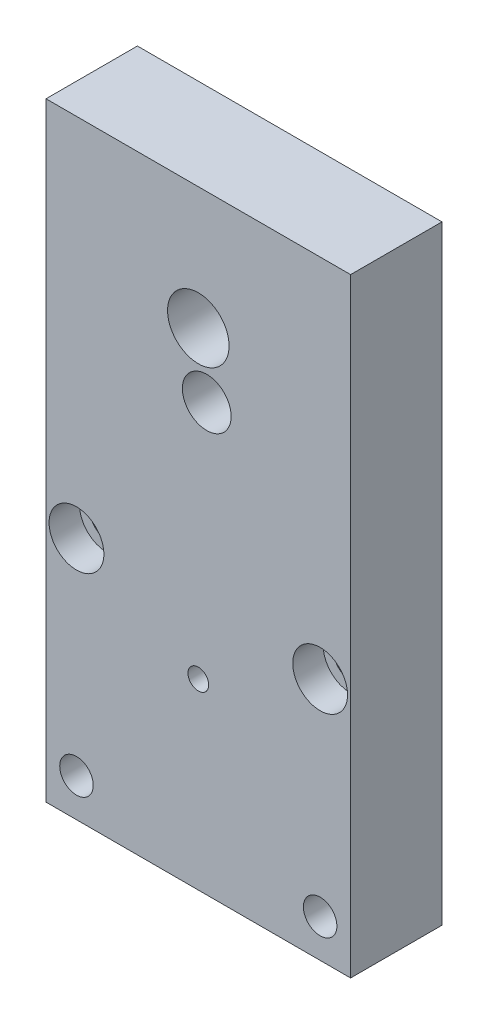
ISO-10303-21;
HEADER;
FILE_DESCRIPTION(('STEP AP214'),'2;1');
FILE_NAME('part.step','',(''),(''),'','','');
FILE_SCHEMA(('AUTOMOTIVE_DESIGN { 1 0 10303 214 1 1 1 1 }'));
ENDSEC;
DATA;
#1=APPLICATION_CONTEXT('core data for automotive mechanical design processes');
#2=APPLICATION_PROTOCOL_DEFINITION('international standard','automotive_design',2000,#1);
#3=PRODUCT_CONTEXT('',#1,'mechanical');
#4=PRODUCT('Part','Part','',(#3));
#5=PRODUCT_RELATED_PRODUCT_CATEGORY('part','',(#4));
#6=PRODUCT_DEFINITION_FORMATION('','',#4);
#7=PRODUCT_DEFINITION_CONTEXT('part definition',#1,'design');
#8=PRODUCT_DEFINITION('design','',#6,#7);
#9=PRODUCT_DEFINITION_SHAPE('','',#8);
#10=(LENGTH_UNIT() NAMED_UNIT(*) SI_UNIT(.MILLI.,.METRE.));
#11=(NAMED_UNIT(*) PLANE_ANGLE_UNIT() SI_UNIT($,.RADIAN.));
#12=(NAMED_UNIT(*) SI_UNIT($,.STERADIAN.) SOLID_ANGLE_UNIT());
#13=UNCERTAINTY_MEASURE_WITH_UNIT(LENGTH_MEASURE(1.E-05),#10,'distance_accuracy_value','');
#14=(GEOMETRIC_REPRESENTATION_CONTEXT(3) GLOBAL_UNCERTAINTY_ASSIGNED_CONTEXT((#13)) GLOBAL_UNIT_ASSIGNED_CONTEXT((#10,
#11,#12)) REPRESENTATION_CONTEXT('',''));
#15=CARTESIAN_POINT('',(0.,0.,0.));
#16=DIRECTION('',(0.,0.,1.));
#17=DIRECTION('',(1.,0.,0.));
#18=AXIS2_PLACEMENT_3D('',#15,#16,#17);
#19=CARTESIAN_POINT('',(-40.,80.,0.));
#20=DIRECTION('',(0.,0.,-1.));
#21=DIRECTION('',(-1.,0.,0.));
#22=AXIS2_PLACEMENT_3D('',#19,#20,#21);
#23=CYLINDRICAL_SURFACE('',#22,5.49999999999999);
#24=CARTESIAN_POINT('',(-40.,80.,0.));
#25=DIRECTION('',(0.,0.,-1.));
#26=DIRECTION('',(-1.,0.,0.));
#27=AXIS2_PLACEMENT_3D('',#24,#25,#26);
#28=CIRCLE('',#27,5.49999999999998);
#29=CARTESIAN_POINT('',(-45.5,80.,0.));
#30=VERTEX_POINT('',#29);
#31=EDGE_CURVE('E159',#30,#30,#28,.T.);
#32=ORIENTED_EDGE('',*,*,#31,.T.);
#33=EDGE_LOOP('',(#32));
#34=FACE_BOUND('',#33,.T.);
#35=CARTESIAN_POINT('',(-40.,80.,20.));
#36=DIRECTION('',(0.,0.,1.));
#37=DIRECTION('',(1.,0.,0.));
#38=AXIS2_PLACEMENT_3D('',#35,#36,#37);
#39=CIRCLE('',#38,5.49999999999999);
#40=CARTESIAN_POINT('',(-34.5,80.,20.));
#41=VERTEX_POINT('',#40);
#42=EDGE_CURVE('E43',#41,#41,#39,.F.);
#43=ORIENTED_EDGE('',*,*,#42,.F.);
#44=EDGE_LOOP('',(#43));
#45=FACE_BOUND('',#44,.T.);
#46=ADVANCED_FACE('F39',(#34,#45),#23,.F.);
#47=CARTESIAN_POINT('',(40.,80.,0.));
#48=DIRECTION('',(0.,0.,-1.));
#49=DIRECTION('',(-1.,0.,0.));
#50=AXIS2_PLACEMENT_3D('',#47,#48,#49);
#51=CYLINDRICAL_SURFACE('',#50,5.49999999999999);
#52=CARTESIAN_POINT('',(40.,80.,0.));
#53=DIRECTION('',(0.,0.,-1.));
#54=DIRECTION('',(-1.,0.,0.));
#55=AXIS2_PLACEMENT_3D('',#52,#53,#54);
#56=CIRCLE('',#55,5.49999999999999);
#57=CARTESIAN_POINT('',(34.5,80.,0.));
#58=VERTEX_POINT('',#57);
#59=EDGE_CURVE('E156',#58,#58,#56,.T.);
#60=ORIENTED_EDGE('',*,*,#59,.T.);
#61=EDGE_LOOP('',(#60));
#62=FACE_BOUND('',#61,.T.);
#63=CARTESIAN_POINT('',(40.,80.,20.));
#64=DIRECTION('',(0.,0.,1.));
#65=DIRECTION('',(1.,0.,0.));
#66=AXIS2_PLACEMENT_3D('',#63,#64,#65);
#67=CIRCLE('',#66,5.49999999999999);
#68=CARTESIAN_POINT('',(45.5,80.,20.));
#69=VERTEX_POINT('',#68);
#70=EDGE_CURVE('E134',#69,#69,#67,.F.);
#71=ORIENTED_EDGE('',*,*,#70,.F.);
#72=EDGE_LOOP('',(#71));
#73=FACE_BOUND('',#72,.T.);
#74=ADVANCED_FACE('F196',(#62,#73),#51,.F.);
#75=CARTESIAN_POINT('',(-50.,0.,30.));
#76=DIRECTION('',(1.,0.,0.));
#77=DIRECTION('',(0.,0.,-1.));
#78=AXIS2_PLACEMENT_3D('',#75,#76,#77);
#79=PLANE('',#78);
#80=DIRECTION('',(0.,-1.,0.));
#81=VECTOR('',#80,1.);
#82=CARTESIAN_POINT('',(-50.,0.,0.));
#83=LINE('',#82,#81);
#84=CARTESIAN_POINT('',(-50.,200.,0.));
#85=VERTEX_POINT('',#84);
#86=CARTESIAN_POINT('',(-50.,0.,0.));
#87=VERTEX_POINT('',#86);
#88=EDGE_CURVE('E174',#85,#87,#83,.T.);
#89=ORIENTED_EDGE('',*,*,#88,.T.);
#90=DIRECTION('',(0.,0.,-1.));
#91=VECTOR('',#90,1.);
#92=CARTESIAN_POINT('',(-50.,0.,30.));
#93=LINE('',#92,#91);
#94=CARTESIAN_POINT('',(-50.,0.,30.));
#95=VERTEX_POINT('',#94);
#96=EDGE_CURVE('E11',#95,#87,#93,.T.);
#97=ORIENTED_EDGE('',*,*,#96,.F.);
#98=DIRECTION('',(0.,-1.,0.));
#99=VECTOR('',#98,1.);
#100=CARTESIAN_POINT('',(-50.,0.,30.));
#101=LINE('',#100,#99);
#102=CARTESIAN_POINT('',(-50.,200.,30.));
#103=VERTEX_POINT('',#102);
#104=EDGE_CURVE('E175',#103,#95,#101,.T.);
#105=ORIENTED_EDGE('',*,*,#104,.F.);
#106=DIRECTION('',(0.,0.,-1.));
#107=VECTOR('',#106,1.);
#108=CARTESIAN_POINT('',(-50.,200.,30.));
#109=LINE('',#108,#107);
#110=EDGE_CURVE('E181',#103,#85,#109,.T.);
#111=ORIENTED_EDGE('',*,*,#110,.T.);
#112=EDGE_LOOP('',(#89,#97,#105,#111));
#113=FACE_BOUND('',#112,.T.);
#114=ADVANCED_FACE('F41',(#113),#79,.F.);
#115=CARTESIAN_POINT('',(-50.,0.,30.));
#116=DIRECTION('',(0.,1.,0.));
#117=DIRECTION('',(-1.,0.,0.));
#118=AXIS2_PLACEMENT_3D('',#115,#116,#117);
#119=PLANE('',#118);
#120=DIRECTION('',(1.,0.,0.));
#121=VECTOR('',#120,1.);
#122=CARTESIAN_POINT('',(-50.,0.,0.));
#123=LINE('',#122,#121);
#124=CARTESIAN_POINT('',(50.,0.,0.));
#125=VERTEX_POINT('',#124);
#126=EDGE_CURVE('E184',#87,#125,#123,.T.);
#127=ORIENTED_EDGE('',*,*,#126,.T.);
#128=DIRECTION('',(0.,0.,-1.));
#129=VECTOR('',#128,1.);
#130=CARTESIAN_POINT('',(50.,0.,30.));
#131=LINE('',#130,#129);
#132=CARTESIAN_POINT('',(50.,0.,30.));
#133=VERTEX_POINT('',#132);
#134=EDGE_CURVE('E49',#133,#125,#131,.T.);
#135=ORIENTED_EDGE('',*,*,#134,.F.);
#136=DIRECTION('',(1.,0.,0.));
#137=VECTOR('',#136,1.);
#138=CARTESIAN_POINT('',(-50.,0.,30.));
#139=LINE('',#138,#137);
#140=EDGE_CURVE('E89',#95,#133,#139,.T.);
#141=ORIENTED_EDGE('',*,*,#140,.F.);
#142=ORIENTED_EDGE('',*,*,#96,.T.);
#143=EDGE_LOOP('',(#127,#135,#141,#142));
#144=FACE_BOUND('',#143,.T.);
#145=ADVANCED_FACE('F204',(#144),#119,.F.);
#146=CARTESIAN_POINT('',(50.,0.,30.));
#147=DIRECTION('',(-1.,0.,0.));
#148=DIRECTION('',(0.,-1.,0.));
#149=AXIS2_PLACEMENT_3D('',#146,#147,#148);
#150=PLANE('',#149);
#151=DIRECTION('',(0.,1.,0.));
#152=VECTOR('',#151,1.);
#153=CARTESIAN_POINT('',(50.,0.,0.));
#154=LINE('',#153,#152);
#155=CARTESIAN_POINT('',(49.9999999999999,200.,0.));
#156=VERTEX_POINT('',#155);
#157=EDGE_CURVE('E76',#125,#156,#154,.T.);
#158=ORIENTED_EDGE('',*,*,#157,.T.);
#159=DIRECTION('',(0.,0.,-1.));
#160=VECTOR('',#159,1.);
#161=CARTESIAN_POINT('',(49.9999999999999,200.,30.));
#162=LINE('',#161,#160);
#163=CARTESIAN_POINT('',(49.9999999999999,200.,30.));
#164=VERTEX_POINT('',#163);
#165=EDGE_CURVE('E189',#164,#156,#162,.T.);
#166=ORIENTED_EDGE('',*,*,#165,.F.);
#167=DIRECTION('',(0.,1.,0.));
#168=VECTOR('',#167,1.);
#169=CARTESIAN_POINT('',(50.,0.,30.));
#170=LINE('',#169,#168);
#171=EDGE_CURVE('E178',#133,#164,#170,.T.);
#172=ORIENTED_EDGE('',*,*,#171,.F.);
#173=ORIENTED_EDGE('',*,*,#134,.T.);
#174=EDGE_LOOP('',(#158,#166,#172,#173));
#175=FACE_BOUND('',#174,.T.);
#176=ADVANCED_FACE('F231',(#175),#150,.F.);
#177=CARTESIAN_POINT('',(-50.,200.,30.));
#178=DIRECTION('',(0.,-1.,0.));
#179=DIRECTION('',(1.,0.,0.));
#180=AXIS2_PLACEMENT_3D('',#177,#178,#179);
#181=PLANE('',#180);
#182=DIRECTION('',(-1.,0.,0.));
#183=VECTOR('',#182,1.);
#184=CARTESIAN_POINT('',(-50.,200.,0.));
#185=LINE('',#184,#183);
#186=EDGE_CURVE('E82',#156,#85,#185,.T.);
#187=ORIENTED_EDGE('',*,*,#186,.T.);
#188=ORIENTED_EDGE('',*,*,#110,.F.);
#189=DIRECTION('',(-1.,0.,0.));
#190=VECTOR('',#189,1.);
#191=CARTESIAN_POINT('',(-50.,200.,30.));
#192=LINE('',#191,#190);
#193=EDGE_CURVE('E58',#164,#103,#192,.T.);
#194=ORIENTED_EDGE('',*,*,#193,.F.);
#195=ORIENTED_EDGE('',*,*,#165,.T.);
#196=EDGE_LOOP('',(#187,#188,#194,#195));
#197=FACE_BOUND('',#196,.T.);
#198=ADVANCED_FACE('F224',(#197),#181,.F.);
#199=CARTESIAN_POINT('',(-50.,200.,30.));
#200=DIRECTION('',(0.,0.,-1.));
#201=DIRECTION('',(-1.,0.,0.));
#202=AXIS2_PLACEMENT_3D('',#199,#200,#201);
#203=PLANE('',#202);
#204=CARTESIAN_POINT('',(2.76954470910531,140.043665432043,30.));
#205=DIRECTION('',(0.,0.,1.));
#206=DIRECTION('',(1.,0.,0.));
#207=AXIS2_PLACEMENT_3D('',#204,#205,#206);
#208=CIRCLE('',#207,8.);
#209=CARTESIAN_POINT('',(10.7695447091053,140.043665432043,30.));
#210=VERTEX_POINT('',#209);
#211=EDGE_CURVE('E113',#210,#210,#208,.T.);
#212=ORIENTED_EDGE('',*,*,#211,.F.);
#213=EDGE_LOOP('',(#212));
#214=FACE_BOUND('',#213,.T.);
#215=CARTESIAN_POINT('',(0.,159.75,30.));
#216=DIRECTION('',(0.,0.,1.));
#217=DIRECTION('',(1.,0.,0.));
#218=AXIS2_PLACEMENT_3D('',#215,#216,#217);
#219=CIRCLE('',#218,10.1);
#220=CARTESIAN_POINT('',(10.1,159.75,30.));
#221=VERTEX_POINT('',#220);
#222=EDGE_CURVE('E119',#221,#221,#219,.T.);
#223=ORIENTED_EDGE('',*,*,#222,.F.);
#224=EDGE_LOOP('',(#223));
#225=FACE_BOUND('',#224,.T.);
#226=CARTESIAN_POINT('',(-40.,80.,30.));
#227=DIRECTION('',(0.,0.,1.));
#228=DIRECTION('',(1.,0.,0.));
#229=AXIS2_PLACEMENT_3D('',#226,#227,#228);
#230=CIRCLE('',#229,9.00000000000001);
#231=CARTESIAN_POINT('',(-31.,80.,30.));
#232=VERTEX_POINT('',#231);
#233=EDGE_CURVE('E123',#232,#232,#230,.T.);
#234=ORIENTED_EDGE('',*,*,#233,.F.);
#235=EDGE_LOOP('',(#234));
#236=FACE_BOUND('',#235,.T.);
#237=CARTESIAN_POINT('',(40.,80.,30.));
#238=DIRECTION('',(0.,0.,1.));
#239=DIRECTION('',(1.,0.,0.));
#240=AXIS2_PLACEMENT_3D('',#237,#238,#239);
#241=CIRCLE('',#240,9.00000000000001);
#242=CARTESIAN_POINT('',(49.,80.,30.));
#243=VERTEX_POINT('',#242);
#244=EDGE_CURVE('E135',#243,#243,#241,.T.);
#245=ORIENTED_EDGE('',*,*,#244,.F.);
#246=EDGE_LOOP('',(#245));
#247=FACE_BOUND('',#246,.T.);
#248=CARTESIAN_POINT('',(0.,60.,30.));
#249=DIRECTION('',(0.,0.,-1.));
#250=DIRECTION('',(-1.,0.,0.));
#251=AXIS2_PLACEMENT_3D('',#248,#249,#250);
#252=CIRCLE('',#251,3.39999999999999);
#253=CARTESIAN_POINT('',(-3.39999999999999,60.,30.));
#254=VERTEX_POINT('',#253);
#255=EDGE_CURVE('E153',#254,#254,#252,.T.);
#256=ORIENTED_EDGE('',*,*,#255,.T.);
#257=EDGE_LOOP('',(#256));
#258=FACE_BOUND('',#257,.T.);
#259=CARTESIAN_POINT('',(-40.,12.5,30.));
#260=DIRECTION('',(0.,0.,-1.));
#261=DIRECTION('',(-1.,0.,0.));
#262=AXIS2_PLACEMENT_3D('',#259,#260,#261);
#263=CIRCLE('',#262,5.49999999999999);
#264=CARTESIAN_POINT('',(-45.5,12.5,30.));
#265=VERTEX_POINT('',#264);
#266=EDGE_CURVE('E165',#265,#265,#263,.T.);
#267=ORIENTED_EDGE('',*,*,#266,.T.);
#268=EDGE_LOOP('',(#267));
#269=FACE_BOUND('',#268,.T.);
#270=CARTESIAN_POINT('',(40.,12.5,30.));
#271=DIRECTION('',(0.,0.,-1.));
#272=DIRECTION('',(-1.,0.,0.));
#273=AXIS2_PLACEMENT_3D('',#270,#271,#272);
#274=CIRCLE('',#273,5.49999999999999);
#275=CARTESIAN_POINT('',(34.5,12.5,30.));
#276=VERTEX_POINT('',#275);
#277=EDGE_CURVE('E171',#276,#276,#274,.T.);
#278=ORIENTED_EDGE('',*,*,#277,.T.);
#279=EDGE_LOOP('',(#278));
#280=FACE_BOUND('',#279,.T.);
#281=ORIENTED_EDGE('',*,*,#104,.T.);
#282=ORIENTED_EDGE('',*,*,#140,.T.);
#283=ORIENTED_EDGE('',*,*,#171,.T.);
#284=ORIENTED_EDGE('',*,*,#193,.T.);
#285=EDGE_LOOP('',(#281,#282,#283,#284));
#286=FACE_BOUND('',#285,.T.);
#287=ADVANCED_FACE('F221',(#214,#225,#236,#247,#258,#269,#280,#286),#203,.F.);
#288=CARTESIAN_POINT('',(-50.,200.,0.));
#289=DIRECTION('',(0.,0.,-1.));
#290=DIRECTION('',(-1.,0.,0.));
#291=AXIS2_PLACEMENT_3D('',#288,#289,#290);
#292=PLANE('',#291);
#293=CARTESIAN_POINT('',(2.76954470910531,140.043665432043,0.));
#294=DIRECTION('',(0.,0.,-1.));
#295=DIRECTION('',(-1.,0.,0.));
#296=AXIS2_PLACEMENT_3D('',#293,#294,#295);
#297=CIRCLE('',#296,8.);
#298=CARTESIAN_POINT('',(-5.2304552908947,140.043665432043,0.));
#299=VERTEX_POINT('',#298);
#300=EDGE_CURVE('E445',#299,#299,#297,.F.);
#301=ORIENTED_EDGE('',*,*,#300,.T.);
#302=EDGE_LOOP('',(#301));
#303=FACE_BOUND('',#302,.T.);
#304=CARTESIAN_POINT('',(-38.,182.5,0.));
#305=DIRECTION('',(0.,0.,-1.));
#306=DIRECTION('',(-1.,0.,0.));
#307=AXIS2_PLACEMENT_3D('',#304,#305,#306);
#308=CIRCLE('',#307,3.4);
#309=CARTESIAN_POINT('',(-41.4,182.5,0.));
#310=VERTEX_POINT('',#309);
#311=EDGE_CURVE('E107',#310,#310,#308,.T.);
#312=ORIENTED_EDGE('',*,*,#311,.F.);
#313=EDGE_LOOP('',(#312));
#314=FACE_BOUND('',#313,.T.);
#315=CARTESIAN_POINT('',(38.,182.5,0.));
#316=DIRECTION('',(0.,0.,-1.));
#317=DIRECTION('',(-1.,0.,0.));
#318=AXIS2_PLACEMENT_3D('',#315,#316,#317);
#319=CIRCLE('',#318,3.4);
#320=CARTESIAN_POINT('',(34.6,182.5,0.));
#321=VERTEX_POINT('',#320);
#322=EDGE_CURVE('E106',#321,#321,#319,.T.);
#323=ORIENTED_EDGE('',*,*,#322,.F.);
#324=EDGE_LOOP('',(#323));
#325=FACE_BOUND('',#324,.T.);
#326=CARTESIAN_POINT('',(0.,159.75,0.));
#327=DIRECTION('',(0.,0.,1.));
#328=DIRECTION('',(1.,0.,0.));
#329=AXIS2_PLACEMENT_3D('',#326,#327,#328);
#330=CIRCLE('',#329,10.1);
#331=CARTESIAN_POINT('',(10.1,159.75,0.));
#332=VERTEX_POINT('',#331);
#333=EDGE_CURVE('E120',#332,#332,#330,.T.);
#334=ORIENTED_EDGE('',*,*,#333,.T.);
#335=EDGE_LOOP('',(#334));
#336=FACE_BOUND('',#335,.T.);
#337=CARTESIAN_POINT('',(0.,78.,0.));
#338=DIRECTION('',(0.,0.,-1.));
#339=DIRECTION('',(-1.,0.,0.));
#340=AXIS2_PLACEMENT_3D('',#337,#338,#339);
#341=CIRCLE('',#340,4.00000000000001);
#342=CARTESIAN_POINT('',(-4.00000000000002,78.,0.));
#343=VERTEX_POINT('',#342);
#344=EDGE_CURVE('E142',#343,#343,#341,.T.);
#345=ORIENTED_EDGE('',*,*,#344,.F.);
#346=EDGE_LOOP('',(#345));
#347=FACE_BOUND('',#346,.T.);
#348=CARTESIAN_POINT('',(0.,42.,0.));
#349=DIRECTION('',(0.,0.,-1.));
#350=DIRECTION('',(-1.,0.,0.));
#351=AXIS2_PLACEMENT_3D('',#348,#349,#350);
#352=CIRCLE('',#351,4.00000000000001);
#353=CARTESIAN_POINT('',(-4.00000000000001,42.,0.));
#354=VERTEX_POINT('',#353);
#355=EDGE_CURVE('E141',#354,#354,#352,.T.);
#356=ORIENTED_EDGE('',*,*,#355,.F.);
#357=EDGE_LOOP('',(#356));
#358=FACE_BOUND('',#357,.T.);
#359=CARTESIAN_POINT('',(0.,60.,0.));
#360=DIRECTION('',(0.,0.,-1.));
#361=DIRECTION('',(-1.,0.,0.));
#362=AXIS2_PLACEMENT_3D('',#359,#360,#361);
#363=CIRCLE('',#362,3.39999999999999);
#364=CARTESIAN_POINT('',(-3.39999999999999,60.,0.));
#365=VERTEX_POINT('',#364);
#366=EDGE_CURVE('E148',#365,#365,#363,.T.);
#367=ORIENTED_EDGE('',*,*,#366,.F.);
#368=EDGE_LOOP('',(#367));
#369=FACE_BOUND('',#368,.T.);
#370=ORIENTED_EDGE('',*,*,#59,.F.);
#371=EDGE_LOOP('',(#370));
#372=FACE_BOUND('',#371,.T.);
#373=ORIENTED_EDGE('',*,*,#31,.F.);
#374=EDGE_LOOP('',(#373));
#375=FACE_BOUND('',#374,.T.);
#376=CARTESIAN_POINT('',(-40.,12.5,0.));
#377=DIRECTION('',(0.,0.,-1.));
#378=DIRECTION('',(-1.,0.,0.));
#379=AXIS2_PLACEMENT_3D('',#376,#377,#378);
#380=CIRCLE('',#379,5.49999999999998);
#381=CARTESIAN_POINT('',(-45.5,12.5,0.));
#382=VERTEX_POINT('',#381);
#383=EDGE_CURVE('E162',#382,#382,#380,.T.);
#384=ORIENTED_EDGE('',*,*,#383,.F.);
#385=EDGE_LOOP('',(#384));
#386=FACE_BOUND('',#385,.T.);
#387=CARTESIAN_POINT('',(40.,12.5,0.));
#388=DIRECTION('',(0.,0.,-1.));
#389=DIRECTION('',(-1.,0.,0.));
#390=AXIS2_PLACEMENT_3D('',#387,#388,#389);
#391=CIRCLE('',#390,5.49999999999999);
#392=CARTESIAN_POINT('',(34.5,12.5,0.));
#393=VERTEX_POINT('',#392);
#394=EDGE_CURVE('E168',#393,#393,#391,.T.);
#395=ORIENTED_EDGE('',*,*,#394,.F.);
#396=EDGE_LOOP('',(#395));
#397=FACE_BOUND('',#396,.T.);
#398=ORIENTED_EDGE('',*,*,#88,.F.);
#399=ORIENTED_EDGE('',*,*,#186,.F.);
#400=ORIENTED_EDGE('',*,*,#157,.F.);
#401=ORIENTED_EDGE('',*,*,#126,.F.);
#402=EDGE_LOOP('',(#398,#399,#400,#401));
#403=FACE_BOUND('',#402,.T.);
#404=ADVANCED_FACE('F219',(#303,#314,#325,#336,#347,#358,#369,#372,#375,#386,#397,#403),#292,.T.);
#405=CARTESIAN_POINT('',(40.,12.5,0.));
#406=DIRECTION('',(0.,0.,-1.));
#407=DIRECTION('',(-1.,0.,0.));
#408=AXIS2_PLACEMENT_3D('',#405,#406,#407);
#409=CYLINDRICAL_SURFACE('',#408,5.49999999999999);
#410=ORIENTED_EDGE('',*,*,#277,.F.);
#411=EDGE_LOOP('',(#410));
#412=FACE_BOUND('',#411,.T.);
#413=ORIENTED_EDGE('',*,*,#394,.T.);
#414=EDGE_LOOP('',(#413));
#415=FACE_BOUND('',#414,.T.);
#416=ADVANCED_FACE('F215',(#412,#415),#409,.F.);
#417=CARTESIAN_POINT('',(-40.,12.5,0.));
#418=DIRECTION('',(0.,0.,-1.));
#419=DIRECTION('',(-1.,0.,0.));
#420=AXIS2_PLACEMENT_3D('',#417,#418,#419);
#421=CYLINDRICAL_SURFACE('',#420,5.49999999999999);
#422=ORIENTED_EDGE('',*,*,#266,.F.);
#423=EDGE_LOOP('',(#422));
#424=FACE_BOUND('',#423,.T.);
#425=ORIENTED_EDGE('',*,*,#383,.T.);
#426=EDGE_LOOP('',(#425));
#427=FACE_BOUND('',#426,.T.);
#428=ADVANCED_FACE('F212',(#424,#427),#421,.F.);
#429=CARTESIAN_POINT('',(0.,60.,0.));
#430=DIRECTION('',(0.,0.,-1.));
#431=DIRECTION('',(-1.,0.,0.));
#432=AXIS2_PLACEMENT_3D('',#429,#430,#431);
#433=CYLINDRICAL_SURFACE('',#432,3.39999999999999);
#434=ORIENTED_EDGE('',*,*,#255,.F.);
#435=EDGE_LOOP('',(#434));
#436=FACE_BOUND('',#435,.T.);
#437=ORIENTED_EDGE('',*,*,#366,.T.);
#438=EDGE_LOOP('',(#437));
#439=FACE_BOUND('',#438,.T.);
#440=ADVANCED_FACE('F209',(#436,#439),#433,.F.);
#441=CARTESIAN_POINT('',(0.,42.,10.));
#442=DIRECTION('',(0.,0.,-1.));
#443=DIRECTION('',(-1.,0.,0.));
#444=AXIS2_PLACEMENT_3D('',#441,#442,#443);
#445=CYLINDRICAL_SURFACE('',#444,4.00000000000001);
#446=CARTESIAN_POINT('',(0.,42.,10.));
#447=DIRECTION('',(0.,0.,-1.));
#448=DIRECTION('',(-1.,0.,0.));
#449=AXIS2_PLACEMENT_3D('',#446,#447,#448);
#450=CIRCLE('',#449,4.00000000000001);
#451=CARTESIAN_POINT('',(-4.00000000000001,42.,10.));
#452=VERTEX_POINT('',#451);
#453=EDGE_CURVE('E145',#452,#452,#450,.T.);
#454=ORIENTED_EDGE('',*,*,#453,.F.);
#455=EDGE_LOOP('',(#454));
#456=FACE_BOUND('',#455,.T.);
#457=ORIENTED_EDGE('',*,*,#355,.T.);
#458=EDGE_LOOP('',(#457));
#459=FACE_BOUND('',#458,.T.);
#460=ADVANCED_FACE('F275',(#456,#459),#445,.F.);
#461=CARTESIAN_POINT('',(0.,42.,10.));
#462=DIRECTION('',(0.,0.,-1.));
#463=DIRECTION('',(-1.,0.,0.));
#464=AXIS2_PLACEMENT_3D('',#461,#462,#463);
#465=PLANE('',#464);
#466=ORIENTED_EDGE('',*,*,#453,.T.);
#467=EDGE_LOOP('',(#466));
#468=FACE_BOUND('',#467,.T.);
#469=ADVANCED_FACE('F282',(#468),#465,.T.);
#470=CARTESIAN_POINT('',(0.,78.,10.));
#471=DIRECTION('',(0.,0.,-1.));
#472=DIRECTION('',(-1.,0.,0.));
#473=AXIS2_PLACEMENT_3D('',#470,#471,#472);
#474=CYLINDRICAL_SURFACE('',#473,4.00000000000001);
#475=CARTESIAN_POINT('',(0.,78.,10.));
#476=DIRECTION('',(0.,0.,-1.));
#477=DIRECTION('',(-1.,0.,0.));
#478=AXIS2_PLACEMENT_3D('',#475,#476,#477);
#479=CIRCLE('',#478,4.00000000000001);
#480=CARTESIAN_POINT('',(-4.00000000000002,78.,10.));
#481=VERTEX_POINT('',#480);
#482=EDGE_CURVE('E138',#481,#481,#479,.T.);
#483=ORIENTED_EDGE('',*,*,#482,.F.);
#484=EDGE_LOOP('',(#483));
#485=FACE_BOUND('',#484,.T.);
#486=ORIENTED_EDGE('',*,*,#344,.T.);
#487=EDGE_LOOP('',(#486));
#488=FACE_BOUND('',#487,.T.);
#489=ADVANCED_FACE('F289',(#485,#488),#474,.F.);
#490=CARTESIAN_POINT('',(0.,78.,10.));
#491=DIRECTION('',(0.,0.,-1.));
#492=DIRECTION('',(-1.,0.,0.));
#493=AXIS2_PLACEMENT_3D('',#490,#491,#492);
#494=PLANE('',#493);
#495=ORIENTED_EDGE('',*,*,#482,.T.);
#496=EDGE_LOOP('',(#495));
#497=FACE_BOUND('',#496,.T.);
#498=ADVANCED_FACE('F298',(#497),#494,.T.);
#499=CARTESIAN_POINT('',(40.,80.,20.));
#500=DIRECTION('',(0.,0.,1.));
#501=DIRECTION('',(1.,0.,0.));
#502=AXIS2_PLACEMENT_3D('',#499,#500,#501);
#503=PLANE('',#502);
#504=CARTESIAN_POINT('',(40.,80.,20.));
#505=DIRECTION('',(0.,0.,1.));
#506=DIRECTION('',(1.,0.,0.));
#507=AXIS2_PLACEMENT_3D('',#504,#505,#506);
#508=CIRCLE('',#507,9.00000000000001);
#509=CARTESIAN_POINT('',(49.,80.,20.));
#510=VERTEX_POINT('',#509);
#511=EDGE_CURVE('E131',#510,#510,#508,.T.);
#512=ORIENTED_EDGE('',*,*,#511,.T.);
#513=EDGE_LOOP('',(#512));
#514=FACE_BOUND('',#513,.T.);
#515=ORIENTED_EDGE('',*,*,#70,.T.);
#516=EDGE_LOOP('',(#515));
#517=FACE_BOUND('',#516,.T.);
#518=ADVANCED_FACE('F194',(#514,#517),#503,.T.);
#519=CARTESIAN_POINT('',(40.,80.,20.));
#520=DIRECTION('',(0.,0.,1.));
#521=DIRECTION('',(1.,0.,0.));
#522=AXIS2_PLACEMENT_3D('',#519,#520,#521);
#523=CYLINDRICAL_SURFACE('',#522,9.00000000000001);
#524=ORIENTED_EDGE('',*,*,#511,.F.);
#525=EDGE_LOOP('',(#524));
#526=FACE_BOUND('',#525,.T.);
#527=ORIENTED_EDGE('',*,*,#244,.T.);
#528=EDGE_LOOP('',(#527));
#529=FACE_BOUND('',#528,.T.);
#530=ADVANCED_FACE('F312',(#526,#529),#523,.F.);
#531=CARTESIAN_POINT('',(-40.,80.,20.));
#532=DIRECTION('',(0.,0.,1.));
#533=DIRECTION('',(1.,0.,0.));
#534=AXIS2_PLACEMENT_3D('',#531,#532,#533);
#535=PLANE('',#534);
#536=CARTESIAN_POINT('',(-40.,80.,20.));
#537=DIRECTION('',(0.,0.,1.));
#538=DIRECTION('',(1.,0.,0.));
#539=AXIS2_PLACEMENT_3D('',#536,#537,#538);
#540=CIRCLE('',#539,9.00000000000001);
#541=CARTESIAN_POINT('',(-31.,80.,20.));
#542=VERTEX_POINT('',#541);
#543=EDGE_CURVE('E126',#542,#542,#540,.T.);
#544=ORIENTED_EDGE('',*,*,#543,.T.);
#545=EDGE_LOOP('',(#544));
#546=FACE_BOUND('',#545,.T.);
#547=ORIENTED_EDGE('',*,*,#42,.T.);
#548=EDGE_LOOP('',(#547));
#549=FACE_BOUND('',#548,.T.);
#550=ADVANCED_FACE('F320',(#546,#549),#535,.T.);
#551=CARTESIAN_POINT('',(-40.,80.,20.));
#552=DIRECTION('',(0.,0.,1.));
#553=DIRECTION('',(1.,0.,0.));
#554=AXIS2_PLACEMENT_3D('',#551,#552,#553);
#555=CYLINDRICAL_SURFACE('',#554,9.00000000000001);
#556=ORIENTED_EDGE('',*,*,#543,.F.);
#557=EDGE_LOOP('',(#556));
#558=FACE_BOUND('',#557,.T.);
#559=ORIENTED_EDGE('',*,*,#233,.T.);
#560=EDGE_LOOP('',(#559));
#561=FACE_BOUND('',#560,.T.);
#562=ADVANCED_FACE('F328',(#558,#561),#555,.F.);
#563=CARTESIAN_POINT('',(0.,159.75,0.));
#564=DIRECTION('',(0.,0.,1.));
#565=DIRECTION('',(1.,0.,0.));
#566=AXIS2_PLACEMENT_3D('',#563,#564,#565);
#567=CYLINDRICAL_SURFACE('',#566,10.1);
#568=ORIENTED_EDGE('',*,*,#333,.F.);
#569=EDGE_LOOP('',(#568));
#570=FACE_BOUND('',#569,.T.);
#571=ORIENTED_EDGE('',*,*,#222,.T.);
#572=EDGE_LOOP('',(#571));
#573=FACE_BOUND('',#572,.T.);
#574=ADVANCED_FACE('F336',(#570,#573),#567,.F.);
#575=CARTESIAN_POINT('',(38.,182.5,22.25));
#576=DIRECTION('',(0.,0.,-1.));
#577=DIRECTION('',(-1.,0.,0.));
#578=AXIS2_PLACEMENT_3D('',#575,#576,#577);
#579=CONICAL_SURFACE('',#578,3.4,1.02974425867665);
#580=CARTESIAN_POINT('',(38.,182.5,24.2929261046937));
#581=VERTEX_POINT('',#580);
#582=VERTEX_LOOP('',#581);
#583=FACE_BOUND('',#582,.T.);
#584=CARTESIAN_POINT('',(38.,182.5,22.25));
#585=DIRECTION('',(0.,0.,-1.));
#586=DIRECTION('',(-1.,0.,0.));
#587=AXIS2_PLACEMENT_3D('',#584,#585,#586);
#588=CIRCLE('',#587,3.4);
#589=CARTESIAN_POINT('',(34.6,182.5,22.25));
#590=VERTEX_POINT('',#589);
#591=EDGE_CURVE('E110',#590,#590,#588,.T.);
#592=ORIENTED_EDGE('',*,*,#591,.T.);
#593=EDGE_LOOP('',(#592));
#594=FACE_BOUND('',#593,.T.);
#595=ADVANCED_FACE('F344',(#583,#594),#579,.F.);
#596=CARTESIAN_POINT('',(38.,182.5,0.));
#597=DIRECTION('',(0.,0.,-1.));
#598=DIRECTION('',(-1.,0.,0.));
#599=AXIS2_PLACEMENT_3D('',#596,#597,#598);
#600=CYLINDRICAL_SURFACE('',#599,3.4);
#601=ORIENTED_EDGE('',*,*,#591,.F.);
#602=EDGE_LOOP('',(#601));
#603=FACE_BOUND('',#602,.T.);
#604=ORIENTED_EDGE('',*,*,#322,.T.);
#605=EDGE_LOOP('',(#604));
#606=FACE_BOUND('',#605,.T.);
#607=ADVANCED_FACE('F100',(#603,#606),#600,.F.);
#608=CARTESIAN_POINT('',(-38.,182.5,22.25));
#609=DIRECTION('',(0.,0.,-1.));
#610=DIRECTION('',(-1.,0.,0.));
#611=AXIS2_PLACEMENT_3D('',#608,#609,#610);
#612=CONICAL_SURFACE('',#611,3.4,1.02974425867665);
#613=CARTESIAN_POINT('',(-38.,182.5,24.2929261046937));
#614=VERTEX_POINT('',#613);
#615=VERTEX_LOOP('',#614);
#616=FACE_BOUND('',#615,.T.);
#617=CARTESIAN_POINT('',(-38.,182.5,22.25));
#618=DIRECTION('',(0.,0.,-1.));
#619=DIRECTION('',(-1.,0.,0.));
#620=AXIS2_PLACEMENT_3D('',#617,#618,#619);
#621=CIRCLE('',#620,3.4);
#622=CARTESIAN_POINT('',(-41.4,182.5,22.25));
#623=VERTEX_POINT('',#622);
#624=EDGE_CURVE('E104',#623,#623,#621,.T.);
#625=ORIENTED_EDGE('',*,*,#624,.T.);
#626=EDGE_LOOP('',(#625));
#627=FACE_BOUND('',#626,.T.);
#628=ADVANCED_FACE('F96',(#616,#627),#612,.F.);
#629=CARTESIAN_POINT('',(-38.,182.5,0.));
#630=DIRECTION('',(0.,0.,-1.));
#631=DIRECTION('',(-1.,0.,0.));
#632=AXIS2_PLACEMENT_3D('',#629,#630,#631);
#633=CYLINDRICAL_SURFACE('',#632,3.4);
#634=ORIENTED_EDGE('',*,*,#624,.F.);
#635=EDGE_LOOP('',(#634));
#636=FACE_BOUND('',#635,.T.);
#637=ORIENTED_EDGE('',*,*,#311,.T.);
#638=EDGE_LOOP('',(#637));
#639=FACE_BOUND('',#638,.T.);
#640=ADVANCED_FACE('F99',(#636,#639),#633,.F.);
#641=CARTESIAN_POINT('',(2.76954470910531,140.043665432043,-0.001000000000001));
#642=DIRECTION('',(0.,0.,1.));
#643=DIRECTION('',(1.,0.,0.));
#644=AXIS2_PLACEMENT_3D('',#641,#642,#643);
#645=CYLINDRICAL_SURFACE('',#644,8.);
#646=ORIENTED_EDGE('',*,*,#300,.F.);
#647=EDGE_LOOP('',(#646));
#648=FACE_BOUND('',#647,.T.);
#649=ORIENTED_EDGE('',*,*,#211,.T.);
#650=EDGE_LOOP('',(#649));
#651=FACE_BOUND('',#650,.T.);
#652=ADVANCED_FACE('F369',(#648,#651),#645,.F.);
#653=CLOSED_SHELL('',(#46,#74,#114,#145,#176,#198,#287,#404,#416,#428,#440,#460,#469,#489,#498,
#518,#530,#550,#562,#574,#595,#607,#628,#640,#652));
#654=MANIFOLD_SOLID_BREP('B2',#653);
#655=ADVANCED_BREP_SHAPE_REPRESENTATION('',(#18,#654),#14);
#656=SHAPE_DEFINITION_REPRESENTATION(#9,#655);
ENDSEC;
END-ISO-10303-21;
